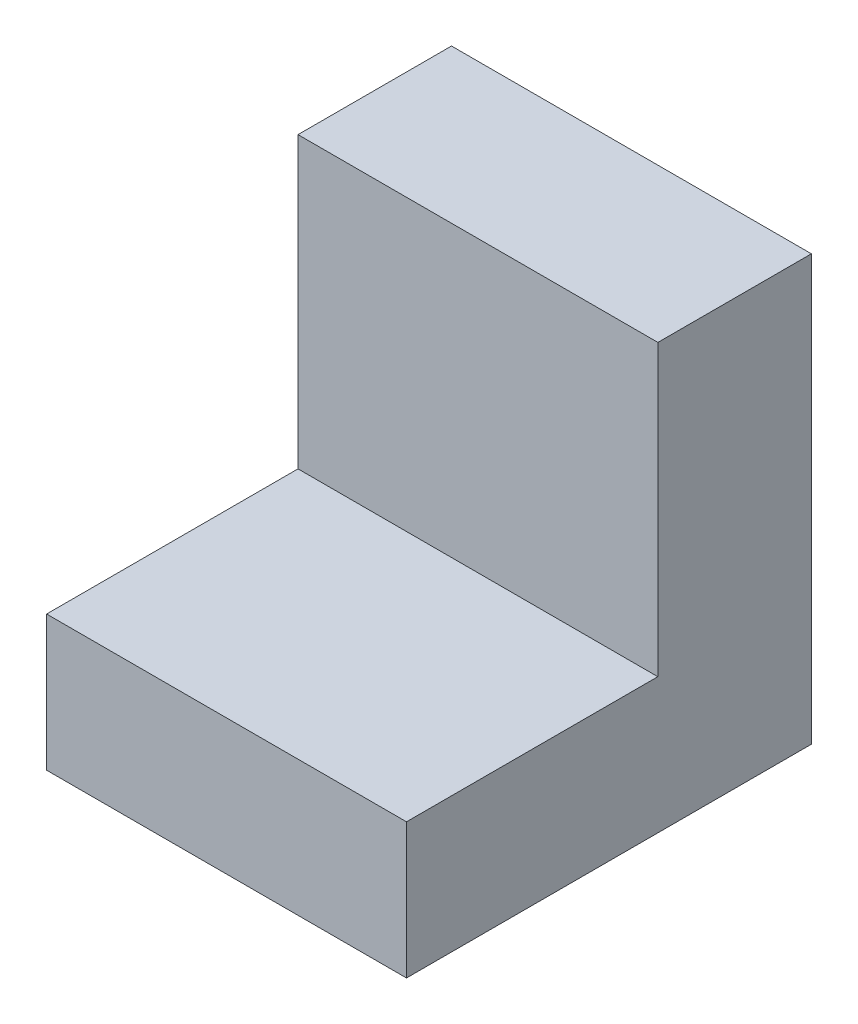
from build123d import *

# Parameters (mm, degrees)
EXTRUDE1_DEPTH     = 116.586
CUT_EXTRUDE1_DEPTH = 14.986


with BuildPart() as part:
    # Sketch1 → Extrude1 (new body)
    with BuildSketch(Plane(origin=(0, 0, 0), x_dir=(0, 0, -1), z_dir=(1, 0, 0))):
        Polygon((0, 0), (131.163465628, 0), (131.163465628, 137.592655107), (81.437760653, 137.592655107), (81.437760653, 43.82310343), (0, 43.82310343), align=None)
    extrude(amount=EXTRUDE1_DEPTH)

    # Sketch2 → Cut-Extrude1 (cut)
    with BuildSketch(Plane(origin=(0, 43.82310343, 0), x_dir=(-1, 0, 0), z_dir=(0, 1, 0))):
        Polygon((-5.325295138, -81.437760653), (-116.586, -81.412360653), (-116.586, -81.437760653), align=None)
    extrude(amount=-CUT_EXTRUDE1_DEPTH, mode=Mode.SUBTRACT)


solid = part.part
